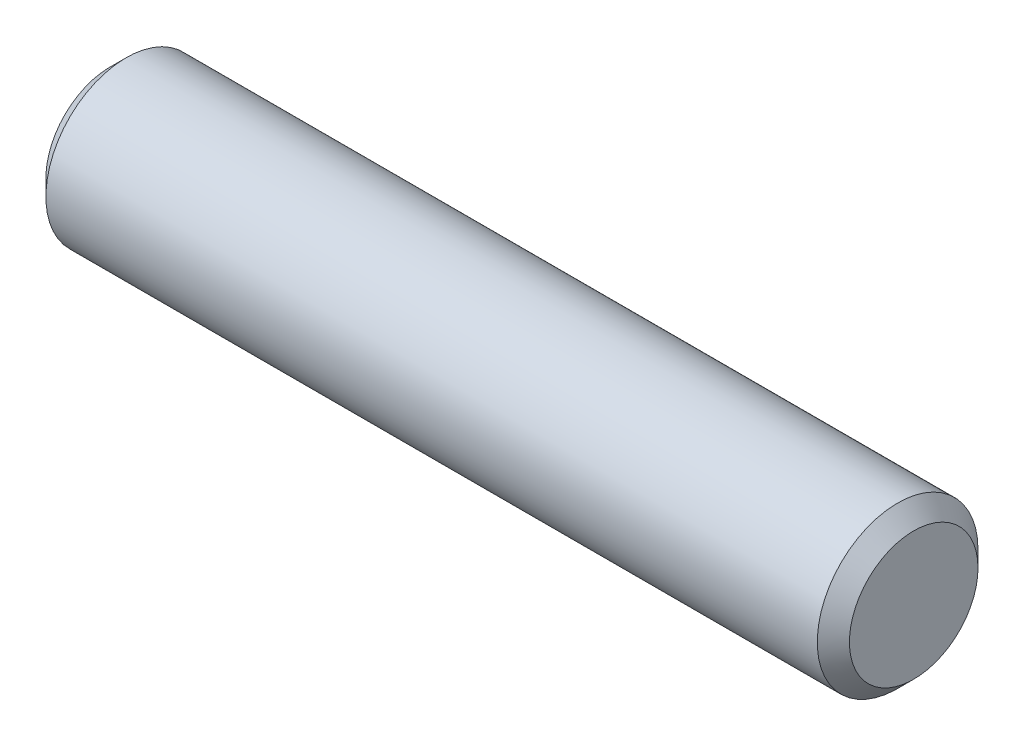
ISO-10303-21;
HEADER;
FILE_DESCRIPTION(('STEP AP214'),'2;1');
FILE_NAME('part.step','',(''),(''),'','','');
FILE_SCHEMA(('AUTOMOTIVE_DESIGN { 1 0 10303 214 1 1 1 1 }'));
ENDSEC;
DATA;
#1=APPLICATION_CONTEXT('core data for automotive mechanical design processes');
#2=APPLICATION_PROTOCOL_DEFINITION('international standard','automotive_design',2000,#1);
#3=PRODUCT_CONTEXT('',#1,'mechanical');
#4=PRODUCT('Part','Part','',(#3));
#5=PRODUCT_RELATED_PRODUCT_CATEGORY('part','',(#4));
#6=PRODUCT_DEFINITION_FORMATION('','',#4);
#7=PRODUCT_DEFINITION_CONTEXT('part definition',#1,'design');
#8=PRODUCT_DEFINITION('design','',#6,#7);
#9=PRODUCT_DEFINITION_SHAPE('','',#8);
#10=(LENGTH_UNIT() NAMED_UNIT(*) SI_UNIT(.MILLI.,.METRE.));
#11=(NAMED_UNIT(*) PLANE_ANGLE_UNIT() SI_UNIT($,.RADIAN.));
#12=(NAMED_UNIT(*) SI_UNIT($,.STERADIAN.) SOLID_ANGLE_UNIT());
#13=UNCERTAINTY_MEASURE_WITH_UNIT(LENGTH_MEASURE(1.E-05),#10,'distance_accuracy_value','');
#14=(GEOMETRIC_REPRESENTATION_CONTEXT(3) GLOBAL_UNCERTAINTY_ASSIGNED_CONTEXT((#13)) GLOBAL_UNIT_ASSIGNED_CONTEXT((#10,
#11,#12)) REPRESENTATION_CONTEXT('',''));
#15=CARTESIAN_POINT('',(0.,0.,0.));
#16=DIRECTION('',(0.,0.,1.));
#17=DIRECTION('',(1.,0.,0.));
#18=AXIS2_PLACEMENT_3D('',#15,#16,#17);
#19=CARTESIAN_POINT('',(-50.,0.,0.));
#20=DIRECTION('',(1.,0.,0.));
#21=DIRECTION('',(0.,0.,-1.));
#22=AXIS2_PLACEMENT_3D('',#19,#20,#21);
#23=CYLINDRICAL_SURFACE('',#22,5.);
#24=CARTESIAN_POINT('',(-1.00000000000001,0.,0.));
#25=DIRECTION('',(1.,0.,0.));
#26=DIRECTION('',(0.,0.,-1.));
#27=AXIS2_PLACEMENT_3D('',#24,#25,#26);
#28=CIRCLE('',#27,5.);
#29=CARTESIAN_POINT('',(-1.00000000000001,0.,-5.00000000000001));
#30=VERTEX_POINT('',#29);
#31=EDGE_CURVE('E48',#30,#30,#28,.F.);
#32=ORIENTED_EDGE('',*,*,#31,.T.);
#33=EDGE_LOOP('',(#32));
#34=FACE_BOUND('',#33,.T.);
#35=CARTESIAN_POINT('',(-49.,0.,0.));
#36=DIRECTION('',(1.,0.,0.));
#37=DIRECTION('',(0.,0.,-1.));
#38=AXIS2_PLACEMENT_3D('',#35,#36,#37);
#39=CIRCLE('',#38,5.);
#40=CARTESIAN_POINT('',(-49.,0.,-5.00000000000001));
#41=VERTEX_POINT('',#40);
#42=EDGE_CURVE('E54',#41,#41,#39,.T.);
#43=ORIENTED_EDGE('',*,*,#42,.T.);
#44=EDGE_LOOP('',(#43));
#45=FACE_BOUND('',#44,.T.);
#46=ADVANCED_FACE('F41',(#34,#45),#23,.T.);
#47=CARTESIAN_POINT('',(-50.,0.,0.));
#48=DIRECTION('',(1.,0.,0.));
#49=DIRECTION('',(0.,0.,-1.));
#50=AXIS2_PLACEMENT_3D('',#47,#48,#49);
#51=PLANE('',#50);
#52=CARTESIAN_POINT('',(-50.,0.,0.));
#53=DIRECTION('',(1.,0.,0.));
#54=DIRECTION('',(0.,0.,-1.));
#55=AXIS2_PLACEMENT_3D('',#52,#53,#54);
#56=CIRCLE('',#55,3.99999999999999);
#57=CARTESIAN_POINT('',(-50.,0.,-4.));
#58=VERTEX_POINT('',#57);
#59=EDGE_CURVE('E10',#58,#58,#56,.F.);
#60=ORIENTED_EDGE('',*,*,#59,.T.);
#61=EDGE_LOOP('',(#60));
#62=FACE_BOUND('',#61,.T.);
#63=ADVANCED_FACE('F81',(#62),#51,.F.);
#64=CARTESIAN_POINT('',(0.,0.,0.));
#65=DIRECTION('',(1.,0.,0.));
#66=DIRECTION('',(0.,0.,-1.));
#67=AXIS2_PLACEMENT_3D('',#64,#65,#66);
#68=PLANE('',#67);
#69=CARTESIAN_POINT('',(0.,0.,0.));
#70=DIRECTION('',(1.,0.,0.));
#71=DIRECTION('',(0.,0.,-1.));
#72=AXIS2_PLACEMENT_3D('',#69,#70,#71);
#73=CIRCLE('',#72,3.99999999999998);
#74=CARTESIAN_POINT('',(0.,0.,-3.99999999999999));
#75=VERTEX_POINT('',#74);
#76=EDGE_CURVE('E60',#75,#75,#73,.T.);
#77=ORIENTED_EDGE('',*,*,#76,.T.);
#78=EDGE_LOOP('',(#77));
#79=FACE_BOUND('',#78,.T.);
#80=ADVANCED_FACE('F68',(#79),#68,.T.);
#81=CARTESIAN_POINT('',(0.,0.,0.));
#82=DIRECTION('',(-1.,0.,0.));
#83=DIRECTION('',(0.,0.,1.));
#84=AXIS2_PLACEMENT_3D('',#81,#82,#83);
#85=CONICAL_SURFACE('',#84,3.99999999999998,0.785398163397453);
#86=ORIENTED_EDGE('',*,*,#31,.F.);
#87=EDGE_LOOP('',(#86));
#88=FACE_BOUND('',#87,.T.);
#89=ORIENTED_EDGE('',*,*,#76,.F.);
#90=EDGE_LOOP('',(#89));
#91=FACE_BOUND('',#90,.T.);
#92=ADVANCED_FACE('F70',(#88,#91),#85,.T.);
#93=CARTESIAN_POINT('',(-49.,0.,0.));
#94=DIRECTION('',(1.,0.,0.));
#95=DIRECTION('',(0.,0.,-1.));
#96=AXIS2_PLACEMENT_3D('',#93,#94,#95);
#97=CONICAL_SURFACE('',#96,5.,0.785398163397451);
#98=ORIENTED_EDGE('',*,*,#59,.F.);
#99=EDGE_LOOP('',(#98));
#100=FACE_BOUND('',#99,.T.);
#101=ORIENTED_EDGE('',*,*,#42,.F.);
#102=EDGE_LOOP('',(#101));
#103=FACE_BOUND('',#102,.T.);
#104=ADVANCED_FACE('F72',(#100,#103),#97,.T.);
#105=CLOSED_SHELL('',(#46,#63,#80,#92,#104));
#106=MANIFOLD_SOLID_BREP('B2',#105);
#107=ADVANCED_BREP_SHAPE_REPRESENTATION('',(#18,#106),#14);
#108=SHAPE_DEFINITION_REPRESENTATION(#9,#107);
ENDSEC;
END-ISO-10303-21;
